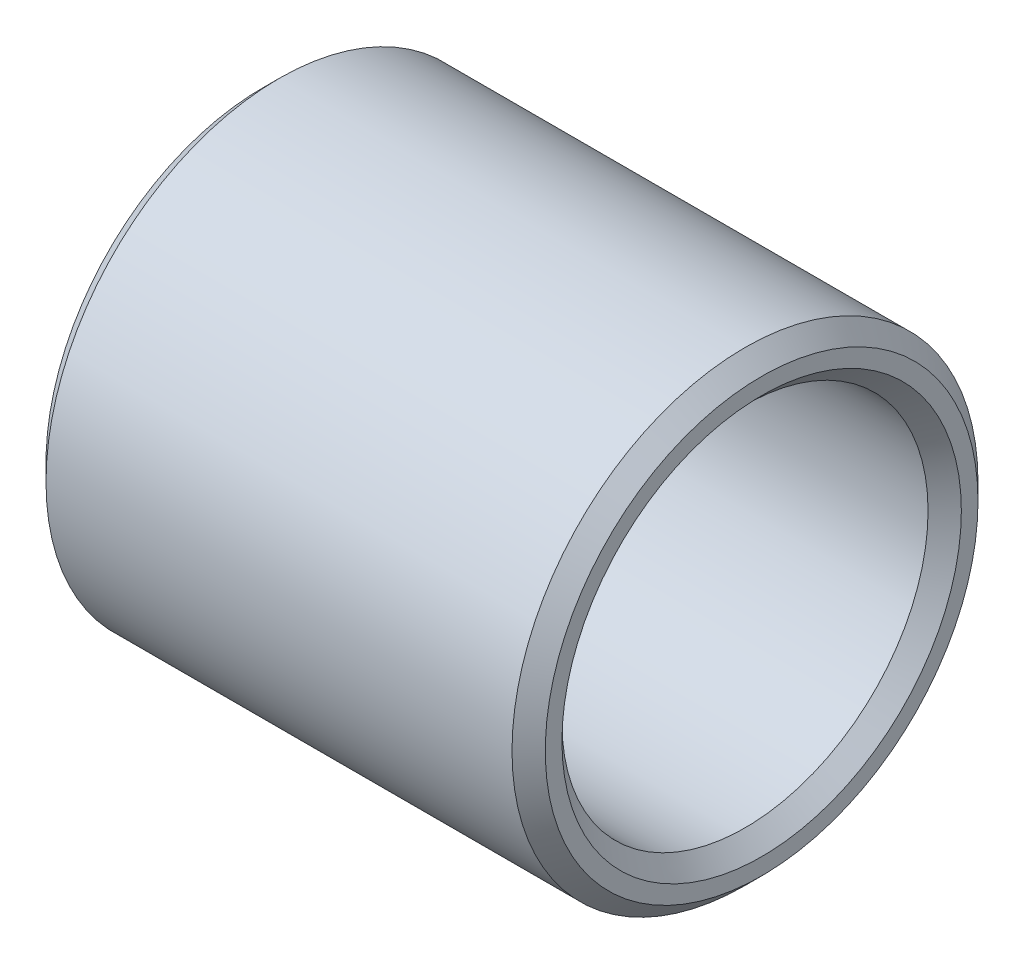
ISO-10303-21;
HEADER;
FILE_DESCRIPTION(('STEP AP214'),'2;1');
FILE_NAME('part.step','',(''),(''),'','','');
FILE_SCHEMA(('AUTOMOTIVE_DESIGN { 1 0 10303 214 1 1 1 1 }'));
ENDSEC;
DATA;
#1=APPLICATION_CONTEXT('core data for automotive mechanical design processes');
#2=APPLICATION_PROTOCOL_DEFINITION('international standard','automotive_design',2000,#1);
#3=PRODUCT_CONTEXT('',#1,'mechanical');
#4=PRODUCT('Part','Part','',(#3));
#5=PRODUCT_RELATED_PRODUCT_CATEGORY('part','',(#4));
#6=PRODUCT_DEFINITION_FORMATION('','',#4);
#7=PRODUCT_DEFINITION_CONTEXT('part definition',#1,'design');
#8=PRODUCT_DEFINITION('design','',#6,#7);
#9=PRODUCT_DEFINITION_SHAPE('','',#8);
#10=(LENGTH_UNIT() NAMED_UNIT(*) SI_UNIT(.MILLI.,.METRE.));
#11=(NAMED_UNIT(*) PLANE_ANGLE_UNIT() SI_UNIT($,.RADIAN.));
#12=(NAMED_UNIT(*) SI_UNIT($,.STERADIAN.) SOLID_ANGLE_UNIT());
#13=UNCERTAINTY_MEASURE_WITH_UNIT(LENGTH_MEASURE(1.E-05),#10,'distance_accuracy_value','');
#14=(GEOMETRIC_REPRESENTATION_CONTEXT(3) GLOBAL_UNCERTAINTY_ASSIGNED_CONTEXT((#13)) GLOBAL_UNIT_ASSIGNED_CONTEXT((#10,
#11,#12)) REPRESENTATION_CONTEXT('',''));
#15=CARTESIAN_POINT('',(0.,0.,0.));
#16=DIRECTION('',(0.,0.,1.));
#17=DIRECTION('',(1.,0.,0.));
#18=AXIS2_PLACEMENT_3D('',#15,#16,#17);
#19=CARTESIAN_POINT('',(0.,13.,0.));
#20=DIRECTION('',(-1.,0.,0.));
#21=DIRECTION('',(0.,0.,1.));
#22=AXIS2_PLACEMENT_3D('',#19,#20,#21);
#23=PLANE('',#22);
#24=CARTESIAN_POINT('',(0.,0.,0.));
#25=DIRECTION('',(1.,0.,0.));
#26=DIRECTION('',(0.,0.,-1.));
#27=AXIS2_PLACEMENT_3D('',#24,#25,#26);
#28=CIRCLE('',#27,12.);
#29=CARTESIAN_POINT('',(0.,0.,-12.));
#30=VERTEX_POINT('',#29);
#31=EDGE_CURVE('E10',#30,#30,#28,.T.);
#32=ORIENTED_EDGE('',*,*,#31,.T.);
#33=EDGE_LOOP('',(#32));
#34=FACE_BOUND('',#33,.T.);
#35=CARTESIAN_POINT('',(0.,0.,0.));
#36=DIRECTION('',(1.,0.,0.));
#37=DIRECTION('',(0.,0.,-1.));
#38=AXIS2_PLACEMENT_3D('',#35,#36,#37);
#39=CIRCLE('',#38,13.);
#40=CARTESIAN_POINT('',(0.,0.,-13.));
#41=VERTEX_POINT('',#40);
#42=EDGE_CURVE('E60',#41,#41,#39,.T.);
#43=ORIENTED_EDGE('',*,*,#42,.F.);
#44=EDGE_LOOP('',(#43));
#45=FACE_BOUND('',#44,.T.);
#46=ADVANCED_FACE('F32',(#34,#45),#23,.T.);
#47=CARTESIAN_POINT('',(0.,0.,0.));
#48=DIRECTION('',(-1.,0.,0.));
#49=DIRECTION('',(0.,0.,1.));
#50=AXIS2_PLACEMENT_3D('',#47,#48,#49);
#51=CONICAL_SURFACE('',#50,12.,0.785398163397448);
#52=CARTESIAN_POINT('',(1.,0.,0.));
#53=DIRECTION('',(1.,0.,0.));
#54=DIRECTION('',(0.,0.,-1.));
#55=AXIS2_PLACEMENT_3D('',#52,#53,#54);
#56=CIRCLE('',#55,11.);
#57=CARTESIAN_POINT('',(1.,0.,-11.));
#58=VERTEX_POINT('',#57);
#59=EDGE_CURVE('E38',#58,#58,#56,.T.);
#60=ORIENTED_EDGE('',*,*,#59,.T.);
#61=EDGE_LOOP('',(#60));
#62=FACE_BOUND('',#61,.T.);
#63=ORIENTED_EDGE('',*,*,#31,.F.);
#64=EDGE_LOOP('',(#63));
#65=FACE_BOUND('',#64,.T.);
#66=ADVANCED_FACE('F68',(#62,#65),#51,.F.);
#67=CARTESIAN_POINT('',(30.,0.,0.));
#68=DIRECTION('',(1.,0.,0.));
#69=DIRECTION('',(0.,0.,-1.));
#70=AXIS2_PLACEMENT_3D('',#67,#68,#69);
#71=CYLINDRICAL_SURFACE('',#70,11.);
#72=CARTESIAN_POINT('',(29.,0.,0.));
#73=DIRECTION('',(1.,0.,0.));
#74=DIRECTION('',(0.,0.,-1.));
#75=AXIS2_PLACEMENT_3D('',#72,#73,#74);
#76=CIRCLE('',#75,11.);
#77=CARTESIAN_POINT('',(29.,0.,-11.));
#78=VERTEX_POINT('',#77);
#79=EDGE_CURVE('E42',#78,#78,#76,.T.);
#80=ORIENTED_EDGE('',*,*,#79,.T.);
#81=EDGE_LOOP('',(#80));
#82=FACE_BOUND('',#81,.T.);
#83=ORIENTED_EDGE('',*,*,#59,.F.);
#84=EDGE_LOOP('',(#83));
#85=FACE_BOUND('',#84,.T.);
#86=ADVANCED_FACE('F72',(#82,#85),#71,.F.);
#87=CARTESIAN_POINT('',(29.,0.,0.));
#88=DIRECTION('',(1.,0.,0.));
#89=DIRECTION('',(0.,0.,-1.));
#90=AXIS2_PLACEMENT_3D('',#87,#88,#89);
#91=CONICAL_SURFACE('',#90,11.,0.78539816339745);
#92=CARTESIAN_POINT('',(30.,0.,0.));
#93=DIRECTION('',(1.,0.,0.));
#94=DIRECTION('',(0.,0.,-1.));
#95=AXIS2_PLACEMENT_3D('',#92,#93,#94);
#96=CIRCLE('',#95,12.);
#97=CARTESIAN_POINT('',(30.,0.,-12.));
#98=VERTEX_POINT('',#97);
#99=EDGE_CURVE('E46',#98,#98,#96,.T.);
#100=ORIENTED_EDGE('',*,*,#99,.T.);
#101=EDGE_LOOP('',(#100));
#102=FACE_BOUND('',#101,.T.);
#103=ORIENTED_EDGE('',*,*,#79,.F.);
#104=EDGE_LOOP('',(#103));
#105=FACE_BOUND('',#104,.T.);
#106=ADVANCED_FACE('F76',(#102,#105),#91,.F.);
#107=CARTESIAN_POINT('',(30.,12.,0.));
#108=DIRECTION('',(1.,0.,0.));
#109=DIRECTION('',(0.,0.,-1.));
#110=AXIS2_PLACEMENT_3D('',#107,#108,#109);
#111=PLANE('',#110);
#112=CARTESIAN_POINT('',(30.,0.,0.));
#113=DIRECTION('',(1.,0.,0.));
#114=DIRECTION('',(0.,0.,-1.));
#115=AXIS2_PLACEMENT_3D('',#112,#113,#114);
#116=CIRCLE('',#115,13.);
#117=CARTESIAN_POINT('',(30.,0.,-13.));
#118=VERTEX_POINT('',#117);
#119=EDGE_CURVE('E51',#118,#118,#116,.T.);
#120=ORIENTED_EDGE('',*,*,#119,.T.);
#121=EDGE_LOOP('',(#120));
#122=FACE_BOUND('',#121,.T.);
#123=ORIENTED_EDGE('',*,*,#99,.F.);
#124=EDGE_LOOP('',(#123));
#125=FACE_BOUND('',#124,.T.);
#126=ADVANCED_FACE('F83',(#122,#125),#111,.T.);
#127=CARTESIAN_POINT('',(30.,0.,0.));
#128=DIRECTION('',(-1.,0.,0.));
#129=DIRECTION('',(0.,0.,1.));
#130=AXIS2_PLACEMENT_3D('',#127,#128,#129);
#131=CONICAL_SURFACE('',#130,13.,0.78539816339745);
#132=CARTESIAN_POINT('',(29.,0.,0.));
#133=DIRECTION('',(1.,0.,0.));
#134=DIRECTION('',(0.,0.,-1.));
#135=AXIS2_PLACEMENT_3D('',#132,#133,#134);
#136=CIRCLE('',#135,14.);
#137=CARTESIAN_POINT('',(29.,0.,-14.));
#138=VERTEX_POINT('',#137);
#139=EDGE_CURVE('E54',#138,#138,#136,.T.);
#140=ORIENTED_EDGE('',*,*,#139,.T.);
#141=EDGE_LOOP('',(#140));
#142=FACE_BOUND('',#141,.T.);
#143=ORIENTED_EDGE('',*,*,#119,.F.);
#144=EDGE_LOOP('',(#143));
#145=FACE_BOUND('',#144,.T.);
#146=ADVANCED_FACE('F87',(#142,#145),#131,.T.);
#147=CARTESIAN_POINT('',(30.,0.,0.));
#148=DIRECTION('',(1.,0.,0.));
#149=DIRECTION('',(0.,0.,-1.));
#150=AXIS2_PLACEMENT_3D('',#147,#148,#149);
#151=CYLINDRICAL_SURFACE('',#150,14.);
#152=CARTESIAN_POINT('',(1.,0.,0.));
#153=DIRECTION('',(1.,0.,0.));
#154=DIRECTION('',(0.,0.,-1.));
#155=AXIS2_PLACEMENT_3D('',#152,#153,#154);
#156=CIRCLE('',#155,14.);
#157=CARTESIAN_POINT('',(1.,0.,-14.));
#158=VERTEX_POINT('',#157);
#159=EDGE_CURVE('E57',#158,#158,#156,.T.);
#160=ORIENTED_EDGE('',*,*,#159,.T.);
#161=EDGE_LOOP('',(#160));
#162=FACE_BOUND('',#161,.T.);
#163=ORIENTED_EDGE('',*,*,#139,.F.);
#164=EDGE_LOOP('',(#163));
#165=FACE_BOUND('',#164,.T.);
#166=ADVANCED_FACE('F91',(#162,#165),#151,.T.);
#167=CARTESIAN_POINT('',(1.,0.,0.));
#168=DIRECTION('',(1.,0.,0.));
#169=DIRECTION('',(0.,0.,-1.));
#170=AXIS2_PLACEMENT_3D('',#167,#168,#169);
#171=CONICAL_SURFACE('',#170,14.,0.785398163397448);
#172=ORIENTED_EDGE('',*,*,#42,.T.);
#173=EDGE_LOOP('',(#172));
#174=FACE_BOUND('',#173,.T.);
#175=ORIENTED_EDGE('',*,*,#159,.F.);
#176=EDGE_LOOP('',(#175));
#177=FACE_BOUND('',#176,.T.);
#178=ADVANCED_FACE('F64',(#174,#177),#171,.T.);
#179=CLOSED_SHELL('',(#46,#66,#86,#106,#126,#146,#166,#178));
#180=MANIFOLD_SOLID_BREP('B2',#179);
#181=ADVANCED_BREP_SHAPE_REPRESENTATION('',(#18,#180),#14);
#182=SHAPE_DEFINITION_REPRESENTATION(#9,#181);
ENDSEC;
END-ISO-10303-21;
